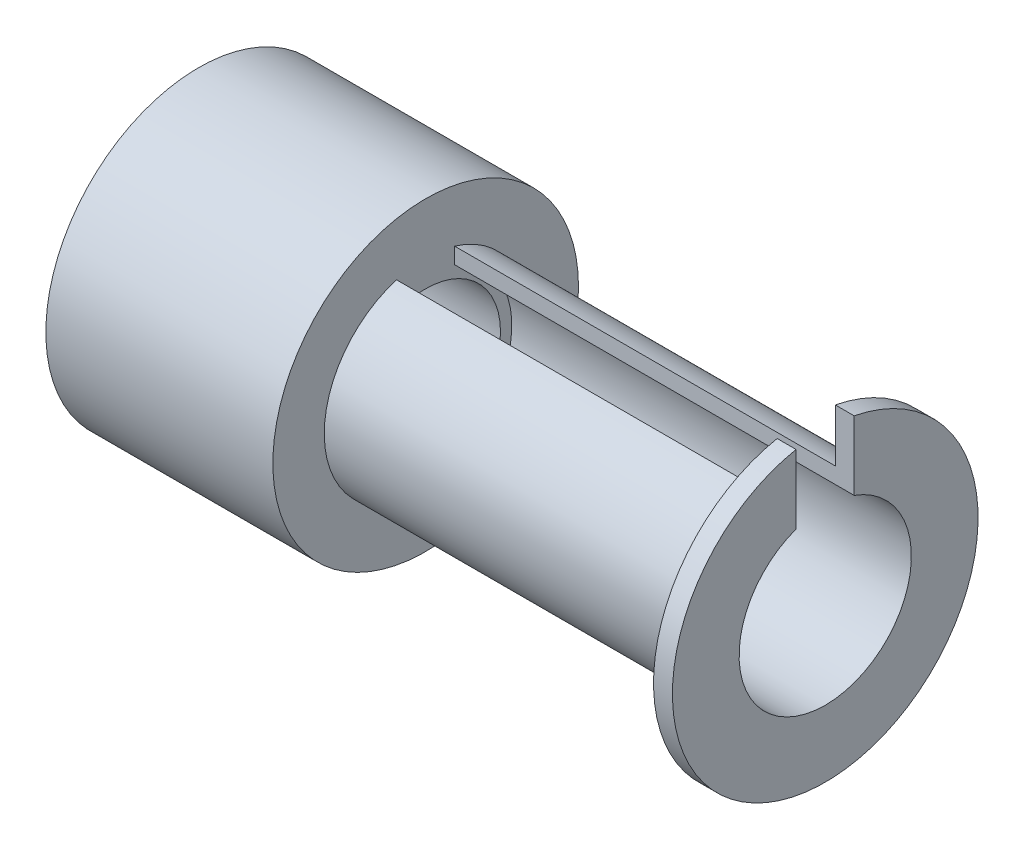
from build123d import *

# Parameters (mm, degrees)
BOSS_EXTRUDE5_DEPTH = 36.5252
SKETCH7_R           = 13.97
SKETCH7_R_2         = 6.839159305
BOSS_EXTRUDE6_DEPTH = 19.05
BOSS_EXTRUDE7_START = -1.7272
BOSS_EXTRUDE7_DEPTH = 1.7272
SKETCH9_R           = 13.97
BOSS_EXTRUDE8_DEPTH = 1.7018


with BuildPart() as part:
    # Sketch6 → Boss-Extrude5 (new body)
    with BuildSketch(Plane(origin=(0, 0, 0), x_dir=(0, 0, -1), z_dir=(1, 0, 0))):
        with BuildLine():
            ThreePointArc((9.271, 0), (7.432610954, 5.541456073), (2.646528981, 8.885230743))
            Line((2.646528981, 8.885230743), (2.646528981, 7.415912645))
            ThreePointArc((2.646528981, 7.415912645), (6.435784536, 4.536579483), (7.874, 0))
            ThreePointArc((7.874, 0), (-4.527342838, -6.442285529), (-2.667793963, 7.408289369))
            Line((-2.667793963, 7.408289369), (-2.667793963, 8.878869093))
            ThreePointArc((-2.667793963, 8.878869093), (-5.532554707, -7.439239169), (9.271, 0))
        make_face()
    extrude(amount=BOSS_EXTRUDE5_DEPTH)

    # Sketch7 → Boss-Extrude6 (add)
    with BuildSketch(Plane(origin=(0, 0, 0), x_dir=(0, 0, -1), z_dir=(1, 0, 0))):
        Circle(SKETCH7_R)
        Circle(SKETCH7_R_2, mode=Mode.SUBTRACT)
    extrude(amount=-BOSS_EXTRUDE6_DEPTH)

    # Sketch8 → Boss-Extrude7 (add)
    with BuildSketch(Plane(origin=(36.5252, 0, 0), x_dir=(0, 0, -1), z_dir=(1, 0, 0)).offset(BOSS_EXTRUDE7_START)):
        with BuildLine():
            ThreePointArc((2.646528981, 8.885230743), (0.011098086, -9.270993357), (-2.667793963, 8.878869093))
            Line((-2.667793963, 8.878869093), (-2.667793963, 13.712905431))
            ThreePointArc((-2.667793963, 13.712905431), (-8.885151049, -10.780305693), (13.97, 0))
            ThreePointArc((13.97, 0), (10.773414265, 8.893505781), (2.646528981, 13.717025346))
            Line((2.646528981, 13.717025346), (2.646528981, 8.885230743))
        make_face()
        with BuildLine():
            ThreePointArc((2.646528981, 7.415912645), (0.011295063, -7.873991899), (-2.667793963, 7.408289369))
            Line((-2.667793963, 7.408289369), (-2.667793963, 8.878869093))
            ThreePointArc((-2.667793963, 8.878869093), (0.011098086, -9.270993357), (2.646528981, 8.885230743))
            Line((2.646528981, 8.885230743), (2.646528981, 7.415912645))
        make_face()
        with BuildLine():
            ThreePointArc((2.646528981, 7.415912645), (0.011295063, -7.873991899), (-2.667793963, 7.408289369))
            Line((-2.667793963, 7.408289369), (-2.667793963, 8.246796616))
            ThreePointArc((-2.667793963, 8.246796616), (0.011170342, -8.667563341), (2.646528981, 8.253645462))
            Line((2.646528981, 8.253645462), (2.646528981, 7.415912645))
        make_face()
    extrude(amount=BOSS_EXTRUDE7_DEPTH)

    # Sketch9 → Boss-Extrude8 (add)
    with BuildSketch(Plane.ZY.offset(19.05)):
        with Locations(Location((0, 0, 0), (0, 0, 180))):
            Circle(SKETCH9_R)
    extrude(amount=BOSS_EXTRUDE8_DEPTH)


solid = part.part
